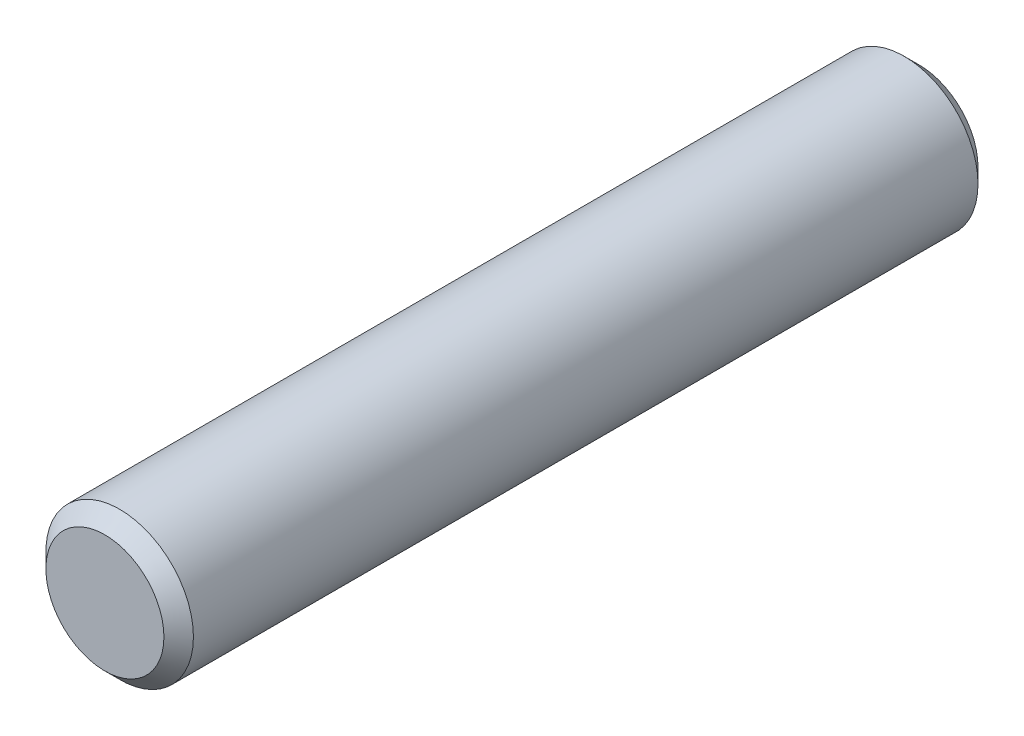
ISO-10303-21;
HEADER;
FILE_DESCRIPTION(('STEP AP214'),'2;1');
FILE_NAME('part.step','',(''),(''),'','','');
FILE_SCHEMA(('AUTOMOTIVE_DESIGN { 1 0 10303 214 1 1 1 1 }'));
ENDSEC;
DATA;
#1=APPLICATION_CONTEXT('core data for automotive mechanical design processes');
#2=APPLICATION_PROTOCOL_DEFINITION('international standard','automotive_design',2000,#1);
#3=PRODUCT_CONTEXT('',#1,'mechanical');
#4=PRODUCT('Part','Part','',(#3));
#5=PRODUCT_RELATED_PRODUCT_CATEGORY('part','',(#4));
#6=PRODUCT_DEFINITION_FORMATION('','',#4);
#7=PRODUCT_DEFINITION_CONTEXT('part definition',#1,'design');
#8=PRODUCT_DEFINITION('design','',#6,#7);
#9=PRODUCT_DEFINITION_SHAPE('','',#8);
#10=(LENGTH_UNIT() NAMED_UNIT(*) SI_UNIT(.MILLI.,.METRE.));
#11=(NAMED_UNIT(*) PLANE_ANGLE_UNIT() SI_UNIT($,.RADIAN.));
#12=(NAMED_UNIT(*) SI_UNIT($,.STERADIAN.) SOLID_ANGLE_UNIT());
#13=UNCERTAINTY_MEASURE_WITH_UNIT(LENGTH_MEASURE(1.E-05),#10,'distance_accuracy_value','');
#14=(GEOMETRIC_REPRESENTATION_CONTEXT(3) GLOBAL_UNCERTAINTY_ASSIGNED_CONTEXT((#13)) GLOBAL_UNIT_ASSIGNED_CONTEXT((#10,
#11,#12)) REPRESENTATION_CONTEXT('',''));
#15=CARTESIAN_POINT('',(0.,0.,0.));
#16=DIRECTION('',(0.,0.,1.));
#17=DIRECTION('',(1.,0.,0.));
#18=AXIS2_PLACEMENT_3D('',#15,#16,#17);
#19=CARTESIAN_POINT('',(0.,0.,0.));
#20=DIRECTION('',(0.,0.,-1.));
#21=DIRECTION('',(-1.,0.,0.));
#22=AXIS2_PLACEMENT_3D('',#19,#20,#21);
#23=PLANE('',#22);
#24=CARTESIAN_POINT('',(0.,0.,0.));
#25=DIRECTION('',(0.,0.,1.));
#26=DIRECTION('',(1.,0.,0.));
#27=AXIS2_PLACEMENT_3D('',#24,#25,#26);
#28=CIRCLE('',#27,2.541016);
#29=CARTESIAN_POINT('',(2.541016,0.,0.));
#30=VERTEX_POINT('',#29);
#31=EDGE_CURVE('E49',#30,#30,#28,.T.);
#32=ORIENTED_EDGE('',*,*,#31,.T.);
#33=EDGE_LOOP('',(#32));
#34=FACE_BOUND('',#33,.T.);
#35=ADVANCED_FACE('F38',(#34),#23,.F.);
#36=CARTESIAN_POINT('',(0.,0.,-0.63525400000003));
#37=DIRECTION('',(0.,0.,-1.));
#38=DIRECTION('',(-1.,0.,0.));
#39=AXIS2_PLACEMENT_3D('',#36,#37,#38);
#40=CONICAL_SURFACE('',#39,3.17627,0.785398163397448);
#41=ORIENTED_EDGE('',*,*,#31,.F.);
#42=EDGE_LOOP('',(#41));
#43=FACE_BOUND('',#42,.T.);
#44=CARTESIAN_POINT('',(0.,0.,-0.63525400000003));
#45=DIRECTION('',(0.,0.,1.));
#46=DIRECTION('',(1.,0.,0.));
#47=AXIS2_PLACEMENT_3D('',#44,#45,#46);
#48=CIRCLE('',#47,3.17627);
#49=CARTESIAN_POINT('',(3.17627,0.,-0.63525400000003));
#50=VERTEX_POINT('',#49);
#51=EDGE_CURVE('E53',#50,#50,#48,.T.);
#52=ORIENTED_EDGE('',*,*,#51,.T.);
#53=EDGE_LOOP('',(#52));
#54=FACE_BOUND('',#53,.T.);
#55=ADVANCED_FACE('F59',(#43,#54),#40,.T.);
#56=CARTESIAN_POINT('',(0.,0.,0.));
#57=DIRECTION('',(0.,0.,1.));
#58=DIRECTION('',(1.,0.,0.));
#59=AXIS2_PLACEMENT_3D('',#56,#57,#58);
#60=CYLINDRICAL_SURFACE('',#59,3.17627);
#61=CARTESIAN_POINT('',(0.,0.,-34.416746));
#62=DIRECTION('',(0.,0.,1.));
#63=DIRECTION('',(1.,0.,0.));
#64=AXIS2_PLACEMENT_3D('',#61,#62,#63);
#65=CIRCLE('',#64,3.17627);
#66=CARTESIAN_POINT('',(3.17627,0.,-34.416746));
#67=VERTEX_POINT('',#66);
#68=EDGE_CURVE('E45',#67,#67,#65,.T.);
#69=ORIENTED_EDGE('',*,*,#68,.T.);
#70=EDGE_LOOP('',(#69));
#71=FACE_BOUND('',#70,.T.);
#72=ORIENTED_EDGE('',*,*,#51,.F.);
#73=EDGE_LOOP('',(#72));
#74=FACE_BOUND('',#73,.T.);
#75=ADVANCED_FACE('F61',(#71,#74),#60,.T.);
#76=CARTESIAN_POINT('',(0.,3.17626999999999,-35.052));
#77=DIRECTION('',(0.,0.,1.));
#78=DIRECTION('',(1.,0.,0.));
#79=AXIS2_PLACEMENT_3D('',#76,#77,#78);
#80=PLANE('',#79);
#81=CARTESIAN_POINT('',(0.,0.,-35.052));
#82=DIRECTION('',(0.,0.,1.));
#83=DIRECTION('',(1.,0.,0.));
#84=AXIS2_PLACEMENT_3D('',#81,#82,#83);
#85=CIRCLE('',#84,2.541016);
#86=CARTESIAN_POINT('',(2.541016,0.,-35.052));
#87=VERTEX_POINT('',#86);
#88=EDGE_CURVE('E10',#87,#87,#85,.F.);
#89=ORIENTED_EDGE('',*,*,#88,.T.);
#90=EDGE_LOOP('',(#89));
#91=FACE_BOUND('',#90,.T.);
#92=ADVANCED_FACE('F63',(#91),#80,.F.);
#93=CARTESIAN_POINT('',(0.,0.,-34.416746));
#94=DIRECTION('',(0.,0.,1.));
#95=DIRECTION('',(1.,0.,0.));
#96=AXIS2_PLACEMENT_3D('',#93,#94,#95);
#97=CONICAL_SURFACE('',#96,3.17627,0.785398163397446);
#98=ORIENTED_EDGE('',*,*,#88,.F.);
#99=EDGE_LOOP('',(#98));
#100=FACE_BOUND('',#99,.T.);
#101=ORIENTED_EDGE('',*,*,#68,.F.);
#102=EDGE_LOOP('',(#101));
#103=FACE_BOUND('',#102,.T.);
#104=ADVANCED_FACE('F40',(#100,#103),#97,.T.);
#105=CLOSED_SHELL('',(#35,#55,#75,#92,#104));
#106=MANIFOLD_SOLID_BREP('B2',#105);
#107=ADVANCED_BREP_SHAPE_REPRESENTATION('',(#18,#106),#14);
#108=SHAPE_DEFINITION_REPRESENTATION(#9,#107);
ENDSEC;
END-ISO-10303-21;
